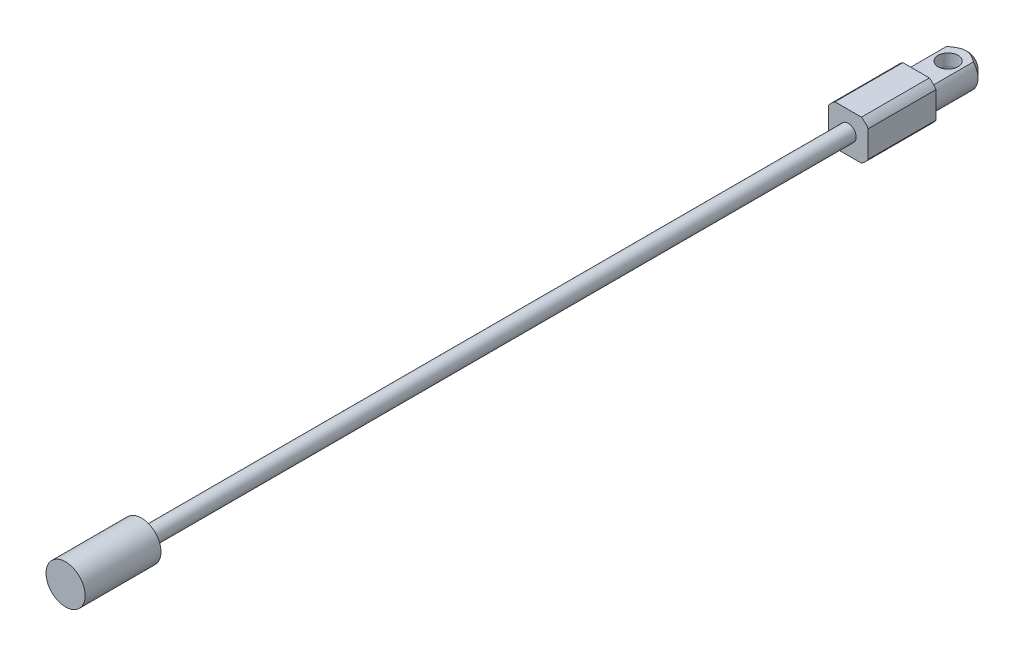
from build123d import *

# Parameters (mm, degrees)
SKETCH1_R          = 5.715
EXTRUDE1_DEPTH     = 16.51
EXTRUDE2_DEPTH     = 21.59
SKETCH3_R          = 2.54
EXTRUDE3_DEPTH     = 224.79
SKETCH4_R          = 6.223
EXTRUDE4_DEPTH     = 24.13
CHAMFER1_SIZE      = 2.54
SKETCH5_W          = 21.390162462
SKETCH5_H          = 6.23037421
CUT_EXTRUDE1_DEPTH = 288.160452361
SKETCH6_R          = 3.175
CUT_EXTRUDE2_DEPTH = 288.269957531


with BuildPart() as part:
    # Sketch1 → Extrude1 (new body)
    with BuildSketch(Plane.XY):
        Circle(SKETCH1_R)
    extrude(amount=EXTRUDE1_DEPTH)

    # Sketch2 → Extrude2 (add)
    with BuildSketch(Plane.XY.offset(16.51)):
        with BuildLine():
            Line((-4.212113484, 6.35), (4.212113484, 6.35))
            ThreePointArc((4.212113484, 6.35), (5.388153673, 5.388153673), (6.35, 4.212113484))
            Line((6.35, 4.212113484), (6.35, -4.212113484))
            ThreePointArc((6.35, -4.212113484), (5.388153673, -5.388153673), (4.212113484, -6.35))
            Line((4.212113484, -6.35), (-4.212113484, -6.35))
            ThreePointArc((-4.212113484, -6.35), (-5.388153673, -5.388153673), (-6.35, -4.212113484))
            Line((-6.35, -4.212113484), (-6.35, 4.212113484))
            ThreePointArc((-6.35, 4.212113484), (-5.388153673, 5.388153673), (-4.212113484, 6.35))
        make_face()
    extrude(amount=EXTRUDE2_DEPTH)

    # Sketch3 → Extrude3 (add)
    with BuildSketch(Plane.XY.offset(38.1)):
        with Locations(Location((0, 0, 0), (0, 0, 180))):
            Circle(SKETCH3_R)
    extrude(amount=EXTRUDE3_DEPTH)

    # Sketch4 → Extrude4 (add)
    with BuildSketch(Plane.XY.offset(262.89)):
        with Locations(Location((0, 0, 0), (0, 0, 180))):
            Circle(SKETCH4_R)
    extrude(amount=EXTRUDE4_DEPTH)

    # Chamfer1
    chamfer1_edges = [part.edges().sort_by_distance(p)[0] for p in [
        (-5.715, 0, 0),
    ]]
    chamfer(chamfer1_edges, length=CHAMFER1_SIZE)

    # Sketch5 → Cut-Extrude1 (cut, symmetric)
    with BuildSketch(Plane(origin=(0, 0, 0), x_dir=(0, 0, -1), z_dir=(1, 0, 0))):
        with Locations((-5.814918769, 6.925187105)):
            Rectangle(SKETCH5_W, SKETCH5_H)
    cut_extrude1 = extrude(amount=CUT_EXTRUDE1_DEPTH, both=True, mode=Mode.SUBTRACT)

    # Mirror1: Cut-Extrude1 across plane
    add(cut_extrude1.mirror(Plane.ZX), mode=Mode.SUBTRACT)

    # Sketch6 → Cut-Extrude2 (cut, through all)
    with BuildSketch(Plane(origin=(0, 3.81, 0), x_dir=(-1, 0, 0), z_dir=(0, 1, 0))):
        with Locations(Location((0, 6.35, 0), (0, 0, 90))):
            Circle(SKETCH6_R)
    extrude(amount=-CUT_EXTRUDE2_DEPTH, mode=Mode.SUBTRACT)


solid = part.part
